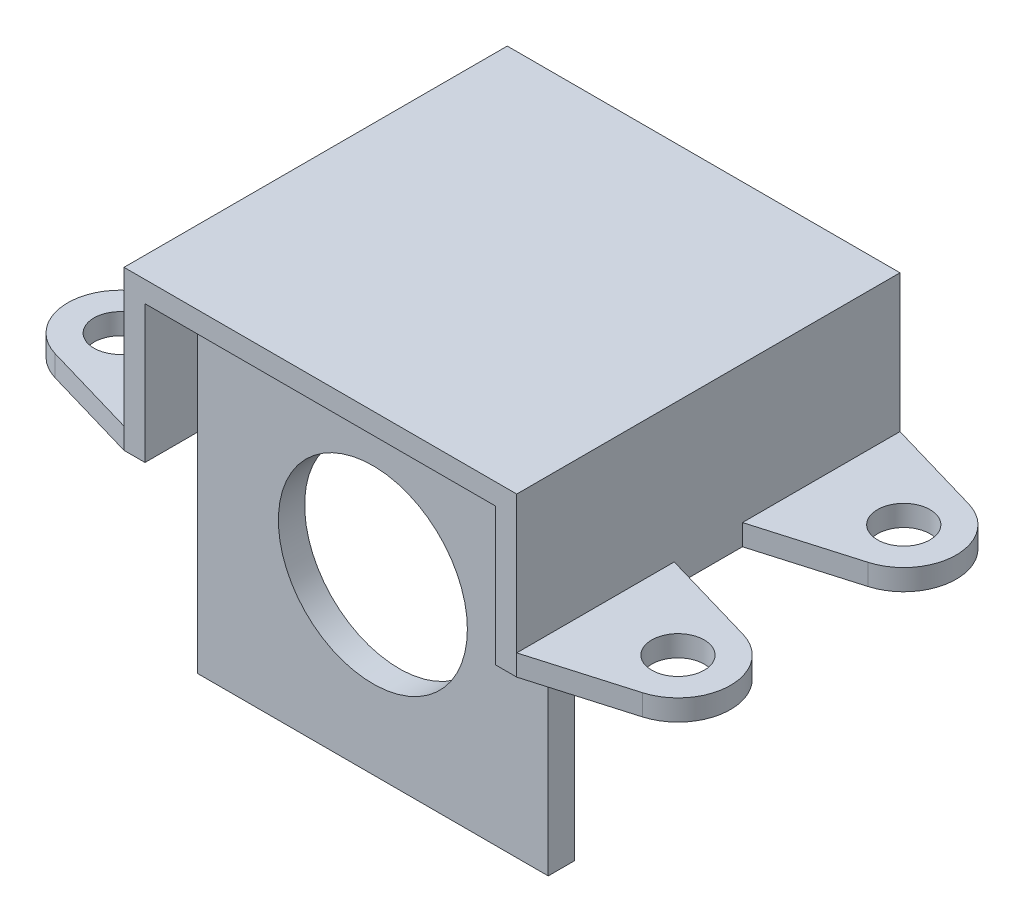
ISO-10303-21;
HEADER;
FILE_DESCRIPTION(('STEP AP214'),'2;1');
FILE_NAME('part.step','',(''),(''),'','','');
FILE_SCHEMA(('AUTOMOTIVE_DESIGN { 1 0 10303 214 1 1 1 1 }'));
ENDSEC;
DATA;
#1=APPLICATION_CONTEXT('core data for automotive mechanical design processes');
#2=APPLICATION_PROTOCOL_DEFINITION('international standard','automotive_design',2000,#1);
#3=PRODUCT_CONTEXT('',#1,'mechanical');
#4=PRODUCT('Part','Part','',(#3));
#5=PRODUCT_RELATED_PRODUCT_CATEGORY('part','',(#4));
#6=PRODUCT_DEFINITION_FORMATION('','',#4);
#7=PRODUCT_DEFINITION_CONTEXT('part definition',#1,'design');
#8=PRODUCT_DEFINITION('design','',#6,#7);
#9=PRODUCT_DEFINITION_SHAPE('','',#8);
#10=(LENGTH_UNIT() NAMED_UNIT(*) SI_UNIT(.MILLI.,.METRE.));
#11=(NAMED_UNIT(*) PLANE_ANGLE_UNIT() SI_UNIT($,.RADIAN.));
#12=(NAMED_UNIT(*) SI_UNIT($,.STERADIAN.) SOLID_ANGLE_UNIT());
#13=UNCERTAINTY_MEASURE_WITH_UNIT(LENGTH_MEASURE(1.E-05),#10,'distance_accuracy_value','');
#14=(GEOMETRIC_REPRESENTATION_CONTEXT(3) GLOBAL_UNCERTAINTY_ASSIGNED_CONTEXT((#13)) GLOBAL_UNIT_ASSIGNED_CONTEXT((#10,
#11,#12)) REPRESENTATION_CONTEXT('',''));
#15=CARTESIAN_POINT('',(0.,0.,0.));
#16=DIRECTION('',(0.,0.,1.));
#17=DIRECTION('',(1.,0.,0.));
#18=AXIS2_PLACEMENT_3D('',#15,#16,#17);
#19=CARTESIAN_POINT('',(0.,13.5410964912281,0.));
#20=DIRECTION('',(0.,-1.,0.));
#21=DIRECTION('',(0.,0.,-1.));
#22=AXIS2_PLACEMENT_3D('',#19,#20,#21);
#23=PLANE('',#22);
#24=DIRECTION('',(0.,0.,1.));
#25=VECTOR('',#24,1.);
#26=CARTESIAN_POINT('',(-26.5920175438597,13.5410964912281,9.525));
#27=LINE('',#26,#25);
#28=CARTESIAN_POINT('',(-26.5920175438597,13.5410964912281,-34.29));
#29=VERTEX_POINT('',#28);
#30=CARTESIAN_POINT('',(-26.5920175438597,13.5410964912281,0.));
#31=VERTEX_POINT('',#30);
#32=EDGE_CURVE('E37',#29,#31,#27,.T.);
#33=ORIENTED_EDGE('',*,*,#32,.F.);
#34=DIRECTION('',(1.,0.,0.));
#35=VECTOR('',#34,1.);
#36=CARTESIAN_POINT('',(15.8259824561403,13.5410964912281,-34.29));
#37=LINE('',#36,#35);
#38=CARTESIAN_POINT('',(15.8259824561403,13.5410964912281,-34.29));
#39=VERTEX_POINT('',#38);
#40=EDGE_CURVE('E53',#29,#39,#37,.T.);
#41=ORIENTED_EDGE('',*,*,#40,.T.);
#42=DIRECTION('',(0.,0.,-1.));
#43=VECTOR('',#42,1.);
#44=CARTESIAN_POINT('',(15.8259824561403,13.5410964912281,9.525));
#45=LINE('',#44,#43);
#46=CARTESIAN_POINT('',(15.8259824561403,13.5410964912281,0.));
#47=VERTEX_POINT('',#46);
#48=EDGE_CURVE('E411',#47,#39,#45,.T.);
#49=ORIENTED_EDGE('',*,*,#48,.F.);
#50=DIRECTION('',(-1.,0.,0.));
#51=VECTOR('',#50,1.);
#52=CARTESIAN_POINT('',(-26.5920175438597,13.5410964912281,0.));
#53=LINE('',#52,#51);
#54=EDGE_CURVE('E425',#47,#31,#53,.T.);
#55=ORIENTED_EDGE('',*,*,#54,.T.);
#56=EDGE_LOOP('',(#33,#41,#49,#55));
#57=FACE_BOUND('',#56,.T.);
#58=ADVANCED_FACE('F33',(#57),#23,.T.);
#59=CARTESIAN_POINT('',(15.8259824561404,0.,0.));
#60=DIRECTION('',(1.,0.,0.));
#61=DIRECTION('',(0.,1.,0.));
#62=AXIS2_PLACEMENT_3D('',#59,#60,#61);
#63=PLANE('',#62);
#64=DIRECTION('',(0.,-1.,0.));
#65=VECTOR('',#64,1.);
#66=CARTESIAN_POINT('',(15.8259824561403,13.5410964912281,-34.29));
#67=LINE('',#66,#65);
#68=CARTESIAN_POINT('',(15.8259824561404,-3.09590350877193,-34.29));
#69=VERTEX_POINT('',#68);
#70=EDGE_CURVE('E60',#39,#69,#67,.T.);
#71=ORIENTED_EDGE('',*,*,#70,.T.);
#72=DIRECTION('',(0.,0.,-1.));
#73=VECTOR('',#72,1.);
#74=CARTESIAN_POINT('',(15.8259824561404,-3.09590350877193,9.525));
#75=LINE('',#74,#73);
#76=CARTESIAN_POINT('',(15.8259824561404,-3.09590350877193,0.));
#77=VERTEX_POINT('',#76);
#78=EDGE_CURVE('E479',#77,#69,#75,.T.);
#79=ORIENTED_EDGE('',*,*,#78,.F.);
#80=DIRECTION('',(0.,1.,0.));
#81=VECTOR('',#80,1.);
#82=CARTESIAN_POINT('',(15.8259824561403,13.5410964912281,0.));
#83=LINE('',#82,#81);
#84=EDGE_CURVE('E417',#77,#47,#83,.T.);
#85=ORIENTED_EDGE('',*,*,#84,.T.);
#86=ORIENTED_EDGE('',*,*,#48,.T.);
#87=EDGE_LOOP('',(#71,#79,#85,#86));
#88=FACE_BOUND('',#87,.T.);
#89=ADVANCED_FACE('F557',(#88),#63,.F.);
#90=CARTESIAN_POINT('',(-26.5920175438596,0.,0.));
#91=DIRECTION('',(-1.,0.,0.));
#92=DIRECTION('',(0.,1.,0.));
#93=AXIS2_PLACEMENT_3D('',#90,#91,#92);
#94=PLANE('',#93);
#95=DIRECTION('',(0.,1.,0.));
#96=VECTOR('',#95,1.);
#97=CARTESIAN_POINT('',(-26.5920175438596,13.5410964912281,-34.29));
#98=LINE('',#97,#96);
#99=CARTESIAN_POINT('',(-26.5920175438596,-3.09590350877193,-34.29));
#100=VERTEX_POINT('',#99);
#101=EDGE_CURVE('E598',#100,#29,#98,.T.);
#102=ORIENTED_EDGE('',*,*,#101,.T.);
#103=ORIENTED_EDGE('',*,*,#32,.T.);
#104=DIRECTION('',(0.,-1.,0.));
#105=VECTOR('',#104,1.);
#106=CARTESIAN_POINT('',(-26.5920175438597,13.5410964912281,0.));
#107=LINE('',#106,#105);
#108=CARTESIAN_POINT('',(-26.5920175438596,-3.09590350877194,0.));
#109=VERTEX_POINT('',#108);
#110=EDGE_CURVE('E433',#31,#109,#107,.T.);
#111=ORIENTED_EDGE('',*,*,#110,.T.);
#112=DIRECTION('',(0.,0.,-1.));
#113=VECTOR('',#112,1.);
#114=CARTESIAN_POINT('',(-26.5920175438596,-3.09590350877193,9.525));
#115=LINE('',#114,#113);
#116=EDGE_CURVE('E46',#109,#100,#115,.T.);
#117=ORIENTED_EDGE('',*,*,#116,.T.);
#118=EDGE_LOOP('',(#102,#103,#111,#117));
#119=FACE_BOUND('',#118,.T.);
#120=ADVANCED_FACE('F564',(#119),#94,.F.);
#121=CARTESIAN_POINT('',(15.8259824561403,13.5410964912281,3.175));
#122=DIRECTION('',(-1.,0.,0.));
#123=DIRECTION('',(0.,-1.,0.));
#124=AXIS2_PLACEMENT_3D('',#121,#122,#123);
#125=PLANE('',#124);
#126=CARTESIAN_POINT('',(15.8259824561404,-3.09590350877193,3.175));
#127=VERTEX_POINT('',#126);
#128=EDGE_CURVE('E43',#127,#77,#75,.T.);
#129=ORIENTED_EDGE('',*,*,#128,.F.);
#130=DIRECTION('',(0.,1.,0.));
#131=VECTOR('',#130,1.);
#132=CARTESIAN_POINT('',(15.8259824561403,13.5410964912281,3.175));
#133=LINE('',#132,#131);
#134=CARTESIAN_POINT('',(15.8259824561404,-28.3689035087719,3.175));
#135=VERTEX_POINT('',#134);
#136=EDGE_CURVE('E415',#135,#127,#133,.T.);
#137=ORIENTED_EDGE('',*,*,#136,.F.);
#138=DIRECTION('',(0.,0.,-1.));
#139=VECTOR('',#138,1.);
#140=CARTESIAN_POINT('',(15.8259824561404,-28.3689035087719,3.175));
#141=LINE('',#140,#139);
#142=CARTESIAN_POINT('',(15.8259824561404,-28.3689035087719,0.));
#143=VERTEX_POINT('',#142);
#144=EDGE_CURVE('E439',#135,#143,#141,.T.);
#145=ORIENTED_EDGE('',*,*,#144,.T.);
#146=EDGE_CURVE('E423',#143,#77,#83,.T.);
#147=ORIENTED_EDGE('',*,*,#146,.T.);
#148=EDGE_LOOP('',(#129,#137,#145,#147));
#149=FACE_BOUND('',#148,.T.);
#150=ADVANCED_FACE('F492',(#149),#125,.F.);
#151=CARTESIAN_POINT('',(0.,0.,3.175));
#152=DIRECTION('',(0.,0.,1.));
#153=DIRECTION('',(1.,0.,0.));
#154=AXIS2_PLACEMENT_3D('',#151,#152,#153);
#155=PLANE('',#154);
#156=DIRECTION('',(0.,-1.,0.));
#157=VECTOR('',#156,1.);
#158=CARTESIAN_POINT('',(-26.5920175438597,13.5410964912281,3.175));
#159=LINE('',#158,#157);
#160=CARTESIAN_POINT('',(-26.5920175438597,13.5410964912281,3.175));
#161=VERTEX_POINT('',#160);
#162=CARTESIAN_POINT('',(-26.5920175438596,-3.09590350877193,3.175));
#163=VERTEX_POINT('',#162);
#164=EDGE_CURVE('E448',#161,#163,#159,.T.);
#165=ORIENTED_EDGE('',*,*,#164,.T.);
#166=CARTESIAN_POINT('',(-26.5920175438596,-28.3689035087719,3.175));
#167=VERTEX_POINT('',#166);
#168=EDGE_CURVE('E432',#163,#167,#159,.T.);
#169=ORIENTED_EDGE('',*,*,#168,.T.);
#170=DIRECTION('',(1.,0.,0.));
#171=VECTOR('',#170,1.);
#172=CARTESIAN_POINT('',(-26.5920175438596,-28.3689035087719,3.175));
#173=LINE('',#172,#171);
#174=EDGE_CURVE('E416',#167,#135,#173,.T.);
#175=ORIENTED_EDGE('',*,*,#174,.T.);
#176=ORIENTED_EDGE('',*,*,#136,.T.);
#177=CARTESIAN_POINT('',(15.8259824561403,13.5410964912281,3.175));
#178=VERTEX_POINT('',#177);
#179=EDGE_CURVE('E412',#127,#178,#133,.T.);
#180=ORIENTED_EDGE('',*,*,#179,.T.);
#181=DIRECTION('',(-1.,0.,0.));
#182=VECTOR('',#181,1.);
#183=CARTESIAN_POINT('',(-26.5920175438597,13.5410964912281,3.175));
#184=LINE('',#183,#182);
#185=EDGE_CURVE('E443',#178,#161,#184,.T.);
#186=ORIENTED_EDGE('',*,*,#185,.T.);
#187=EDGE_LOOP('',(#165,#169,#175,#176,#180,#186));
#188=FACE_BOUND('',#187,.T.);
#189=CARTESIAN_POINT('',(-5.38301754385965,-7.41390350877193,3.175));
#190=DIRECTION('',(0.,0.,1.));
#191=DIRECTION('',(1.,0.,0.));
#192=AXIS2_PLACEMENT_3D('',#189,#190,#191);
#193=CIRCLE('',#192,11.43);
#194=CARTESIAN_POINT('',(6.04698245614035,-7.41390350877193,3.175));
#195=VERTEX_POINT('',#194);
#196=EDGE_CURVE('E455',#195,#195,#193,.T.);
#197=ORIENTED_EDGE('',*,*,#196,.F.);
#198=EDGE_LOOP('',(#197));
#199=FACE_BOUND('',#198,.T.);
#200=ADVANCED_FACE('F498',(#188,#199),#155,.T.);
#201=CARTESIAN_POINT('',(0.,0.,0.));
#202=DIRECTION('',(0.,0.,1.));
#203=DIRECTION('',(1.,0.,0.));
#204=AXIS2_PLACEMENT_3D('',#201,#202,#203);
#205=PLANE('',#204);
#206=ORIENTED_EDGE('',*,*,#110,.F.);
#207=ORIENTED_EDGE('',*,*,#54,.F.);
#208=ORIENTED_EDGE('',*,*,#84,.F.);
#209=ORIENTED_EDGE('',*,*,#146,.F.);
#210=DIRECTION('',(1.,0.,0.));
#211=VECTOR('',#210,1.);
#212=CARTESIAN_POINT('',(-26.5920175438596,-28.3689035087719,0.));
#213=LINE('',#212,#211);
#214=CARTESIAN_POINT('',(-26.5920175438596,-28.3689035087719,0.));
#215=VERTEX_POINT('',#214);
#216=EDGE_CURVE('E437',#215,#143,#213,.T.);
#217=ORIENTED_EDGE('',*,*,#216,.F.);
#218=EDGE_CURVE('E396',#109,#215,#107,.T.);
#219=ORIENTED_EDGE('',*,*,#218,.F.);
#220=EDGE_LOOP('',(#206,#207,#208,#209,#217,#219));
#221=FACE_BOUND('',#220,.T.);
#222=CARTESIAN_POINT('',(-5.38301754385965,-7.41390350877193,0.));
#223=DIRECTION('',(0.,0.,1.));
#224=DIRECTION('',(1.,0.,0.));
#225=AXIS2_PLACEMENT_3D('',#222,#223,#224);
#226=CIRCLE('',#225,11.43);
#227=CARTESIAN_POINT('',(6.04698245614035,-7.41390350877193,0.));
#228=VERTEX_POINT('',#227);
#229=EDGE_CURVE('E452',#228,#228,#226,.T.);
#230=ORIENTED_EDGE('',*,*,#229,.T.);
#231=EDGE_LOOP('',(#230));
#232=FACE_BOUND('',#231,.T.);
#233=ADVANCED_FACE('F591',(#221,#232),#205,.F.);
#234=CARTESIAN_POINT('',(-26.5920175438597,13.5410964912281,3.175));
#235=DIRECTION('',(1.,0.,0.));
#236=DIRECTION('',(0.,1.,0.));
#237=AXIS2_PLACEMENT_3D('',#234,#235,#236);
#238=PLANE('',#237);
#239=ORIENTED_EDGE('',*,*,#168,.F.);
#240=EDGE_CURVE('E11',#163,#109,#115,.T.);
#241=ORIENTED_EDGE('',*,*,#240,.T.);
#242=ORIENTED_EDGE('',*,*,#218,.T.);
#243=DIRECTION('',(0.,0.,-1.));
#244=VECTOR('',#243,1.);
#245=CARTESIAN_POINT('',(-26.5920175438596,-28.3689035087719,3.175));
#246=LINE('',#245,#244);
#247=EDGE_CURVE('E442',#167,#215,#246,.T.);
#248=ORIENTED_EDGE('',*,*,#247,.F.);
#249=EDGE_LOOP('',(#239,#241,#242,#248));
#250=FACE_BOUND('',#249,.T.);
#251=ADVANCED_FACE('F35',(#250),#238,.F.);
#252=CARTESIAN_POINT('',(-26.5920175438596,-28.3689035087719,3.175));
#253=DIRECTION('',(0.,1.,0.));
#254=DIRECTION('',(0.,0.,1.));
#255=AXIS2_PLACEMENT_3D('',#252,#253,#254);
#256=PLANE('',#255);
#257=ORIENTED_EDGE('',*,*,#216,.T.);
#258=ORIENTED_EDGE('',*,*,#144,.F.);
#259=ORIENTED_EDGE('',*,*,#174,.F.);
#260=ORIENTED_EDGE('',*,*,#247,.T.);
#261=EDGE_LOOP('',(#257,#258,#259,#260));
#262=FACE_BOUND('',#261,.T.);
#263=ADVANCED_FACE('F577',(#262),#256,.F.);
#264=CARTESIAN_POINT('',(-5.38301754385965,-7.41390350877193,3.175));
#265=DIRECTION('',(0.,0.,-1.));
#266=DIRECTION('',(-1.,0.,0.));
#267=AXIS2_PLACEMENT_3D('',#264,#265,#266);
#268=CYLINDRICAL_SURFACE('',#267,11.43);
#269=ORIENTED_EDGE('',*,*,#196,.T.);
#270=EDGE_LOOP('',(#269));
#271=FACE_BOUND('',#270,.T.);
#272=ORIENTED_EDGE('',*,*,#229,.F.);
#273=EDGE_LOOP('',(#272));
#274=FACE_BOUND('',#273,.T.);
#275=ADVANCED_FACE('F569',(#271,#274),#268,.F.);
#276=ORIENTED_EDGE('',*,*,#185,.F.);
#277=CARTESIAN_POINT('',(15.8259824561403,13.5410964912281,9.525));
#278=VERTEX_POINT('',#277);
#279=EDGE_CURVE('E461',#278,#178,#45,.T.);
#280=ORIENTED_EDGE('',*,*,#279,.F.);
#281=DIRECTION('',(1.,0.,0.));
#282=VECTOR('',#281,1.);
#283=CARTESIAN_POINT('',(-26.5920175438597,13.5410964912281,9.525));
#284=LINE('',#283,#282);
#285=CARTESIAN_POINT('',(-26.5920175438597,13.5410964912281,9.525));
#286=VERTEX_POINT('',#285);
#287=EDGE_CURVE('E409',#286,#278,#284,.T.);
#288=ORIENTED_EDGE('',*,*,#287,.F.);
#289=EDGE_CURVE('E466',#161,#286,#27,.T.);
#290=ORIENTED_EDGE('',*,*,#289,.F.);
#291=EDGE_LOOP('',(#276,#280,#288,#290));
#292=FACE_BOUND('',#291,.T.);
#293=ADVANCED_FACE('F559',(#292),#23,.T.);
#294=CARTESIAN_POINT('',(-26.5920175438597,16.0810964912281,9.525));
#295=DIRECTION('',(0.,0.,-1.));
#296=DIRECTION('',(-1.,0.,0.));
#297=AXIS2_PLACEMENT_3D('',#294,#295,#296);
#298=PLANE('',#297);
#299=ORIENTED_EDGE('',*,*,#287,.T.);
#300=DIRECTION('',(0.,-1.,0.));
#301=VECTOR('',#300,1.);
#302=CARTESIAN_POINT('',(15.8259824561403,16.0810964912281,9.525));
#303=LINE('',#302,#301);
#304=CARTESIAN_POINT('',(15.8259824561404,-3.09590350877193,9.525));
#305=VERTEX_POINT('',#304);
#306=EDGE_CURVE('E382',#278,#305,#303,.T.);
#307=ORIENTED_EDGE('',*,*,#306,.T.);
#308=DIRECTION('',(-1.,0.,0.));
#309=VECTOR('',#308,1.);
#310=CARTESIAN_POINT('',(18.3659824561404,-3.09590350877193,9.525));
#311=LINE('',#310,#309);
#312=CARTESIAN_POINT('',(18.3659824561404,-3.09590350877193,9.525));
#313=VERTEX_POINT('',#312);
#314=EDGE_CURVE('E468',#313,#305,#311,.T.);
#315=ORIENTED_EDGE('',*,*,#314,.F.);
#316=DIRECTION('',(0.,-1.,0.));
#317=VECTOR('',#316,1.);
#318=CARTESIAN_POINT('',(18.3659824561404,-0.555903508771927,9.525));
#319=LINE('',#318,#317);
#320=CARTESIAN_POINT('',(18.3659824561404,-0.55590350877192,9.525));
#321=VERTEX_POINT('',#320);
#322=EDGE_CURVE('E345',#321,#313,#319,.T.);
#323=ORIENTED_EDGE('',*,*,#322,.F.);
#324=DIRECTION('',(0.,-1.,0.));
#325=VECTOR('',#324,1.);
#326=CARTESIAN_POINT('',(18.3659824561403,16.0810964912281,9.525));
#327=LINE('',#326,#325);
#328=CARTESIAN_POINT('',(18.3659824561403,16.0810964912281,9.525));
#329=VERTEX_POINT('',#328);
#330=EDGE_CURVE('E395',#329,#321,#327,.T.);
#331=ORIENTED_EDGE('',*,*,#330,.F.);
#332=DIRECTION('',(1.,0.,0.));
#333=VECTOR('',#332,1.);
#334=CARTESIAN_POINT('',(-26.5920175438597,16.0810964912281,9.525));
#335=LINE('',#334,#333);
#336=CARTESIAN_POINT('',(-29.1320175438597,16.0810964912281,9.525));
#337=VERTEX_POINT('',#336);
#338=EDGE_CURVE('E262',#337,#329,#335,.T.);
#339=ORIENTED_EDGE('',*,*,#338,.F.);
#340=DIRECTION('',(0.,-1.,0.));
#341=VECTOR('',#340,1.);
#342=CARTESIAN_POINT('',(-29.1320175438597,16.0810964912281,9.525));
#343=LINE('',#342,#341);
#344=CARTESIAN_POINT('',(-29.1320175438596,-0.555903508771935,9.525));
#345=VERTEX_POINT('',#344);
#346=EDGE_CURVE('E254',#337,#345,#343,.T.);
#347=ORIENTED_EDGE('',*,*,#346,.T.);
#348=DIRECTION('',(0.,-1.,0.));
#349=VECTOR('',#348,1.);
#350=CARTESIAN_POINT('',(-29.1320175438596,-0.555903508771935,9.525));
#351=LINE('',#350,#349);
#352=CARTESIAN_POINT('',(-29.1320175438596,-3.09590350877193,9.525));
#353=VERTEX_POINT('',#352);
#354=EDGE_CURVE('E238',#345,#353,#351,.T.);
#355=ORIENTED_EDGE('',*,*,#354,.T.);
#356=DIRECTION('',(1.,0.,0.));
#357=VECTOR('',#356,1.);
#358=CARTESIAN_POINT('',(-29.1320175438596,-3.09590350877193,9.525));
#359=LINE('',#358,#357);
#360=CARTESIAN_POINT('',(-26.5920175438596,-3.09590350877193,9.525));
#361=VERTEX_POINT('',#360);
#362=EDGE_CURVE('E306',#353,#361,#359,.T.);
#363=ORIENTED_EDGE('',*,*,#362,.T.);
#364=DIRECTION('',(0.,-1.,0.));
#365=VECTOR('',#364,1.);
#366=CARTESIAN_POINT('',(-26.5920175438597,16.0810964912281,9.525));
#367=LINE('',#366,#365);
#368=EDGE_CURVE('E318',#286,#361,#367,.T.);
#369=ORIENTED_EDGE('',*,*,#368,.F.);
#370=EDGE_LOOP('',(#299,#307,#315,#323,#331,#339,#347,#355,#363,#369));
#371=FACE_BOUND('',#370,.T.);
#372=ADVANCED_FACE('F260',(#371),#298,.F.);
#373=CARTESIAN_POINT('',(-26.5920175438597,16.0810964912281,-36.83));
#374=DIRECTION('',(0.,0.,1.));
#375=DIRECTION('',(1.,0.,0.));
#376=AXIS2_PLACEMENT_3D('',#373,#374,#375);
#377=PLANE('',#376);
#378=DIRECTION('',(-1.,0.,0.));
#379=VECTOR('',#378,1.);
#380=CARTESIAN_POINT('',(18.3659824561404,-3.09590350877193,-36.83));
#381=LINE('',#380,#379);
#382=CARTESIAN_POINT('',(18.3659824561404,-3.09590350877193,-36.83));
#383=VERTEX_POINT('',#382);
#384=CARTESIAN_POINT('',(-29.1320175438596,-3.09590350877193,-36.83));
#385=VERTEX_POINT('',#384);
#386=EDGE_CURVE('E472',#383,#385,#381,.T.);
#387=ORIENTED_EDGE('',*,*,#386,.T.);
#388=DIRECTION('',(0.,1.,0.));
#389=VECTOR('',#388,1.);
#390=CARTESIAN_POINT('',(-29.1320175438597,16.0810964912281,-36.83));
#391=LINE('',#390,#389);
#392=CARTESIAN_POINT('',(-29.1320175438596,-0.555903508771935,-36.83));
#393=VERTEX_POINT('',#392);
#394=EDGE_CURVE('E280',#385,#393,#391,.T.);
#395=ORIENTED_EDGE('',*,*,#394,.T.);
#396=CARTESIAN_POINT('',(-29.1320175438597,16.0810964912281,-36.83));
#397=VERTEX_POINT('',#396);
#398=EDGE_CURVE('E265',#393,#397,#391,.T.);
#399=ORIENTED_EDGE('',*,*,#398,.T.);
#400=DIRECTION('',(-1.,0.,0.));
#401=VECTOR('',#400,1.);
#402=CARTESIAN_POINT('',(-26.5920175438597,16.0810964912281,-36.83));
#403=LINE('',#402,#401);
#404=CARTESIAN_POINT('',(18.3659824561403,16.0810964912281,-36.83));
#405=VERTEX_POINT('',#404);
#406=EDGE_CURVE('E456',#405,#397,#403,.T.);
#407=ORIENTED_EDGE('',*,*,#406,.F.);
#408=DIRECTION('',(0.,1.,0.));
#409=VECTOR('',#408,1.);
#410=CARTESIAN_POINT('',(18.3659824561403,16.0810964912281,-36.83));
#411=LINE('',#410,#409);
#412=CARTESIAN_POINT('',(18.3659824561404,-0.555903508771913,-36.83));
#413=VERTEX_POINT('',#412);
#414=EDGE_CURVE('E394',#413,#405,#411,.T.);
#415=ORIENTED_EDGE('',*,*,#414,.F.);
#416=EDGE_CURVE('E372',#383,#413,#411,.T.);
#417=ORIENTED_EDGE('',*,*,#416,.F.);
#418=EDGE_LOOP('',(#387,#395,#399,#407,#415,#417));
#419=FACE_BOUND('',#418,.T.);
#420=ADVANCED_FACE('F521',(#419),#377,.F.);
#421=CARTESIAN_POINT('',(0.,16.0810964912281,0.));
#422=DIRECTION('',(0.,-1.,0.));
#423=DIRECTION('',(0.,0.,-1.));
#424=AXIS2_PLACEMENT_3D('',#421,#422,#423);
#425=PLANE('',#424);
#426=ORIENTED_EDGE('',*,*,#406,.T.);
#427=DIRECTION('',(0.,0.,1.));
#428=VECTOR('',#427,1.);
#429=CARTESIAN_POINT('',(-29.1320175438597,16.0810964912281,9.525));
#430=LINE('',#429,#428);
#431=EDGE_CURVE('E263',#397,#337,#430,.T.);
#432=ORIENTED_EDGE('',*,*,#431,.T.);
#433=ORIENTED_EDGE('',*,*,#338,.T.);
#434=DIRECTION('',(0.,0.,1.));
#435=VECTOR('',#434,1.);
#436=CARTESIAN_POINT('',(18.3659824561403,16.0810964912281,9.525));
#437=LINE('',#436,#435);
#438=EDGE_CURVE('E403',#405,#329,#437,.T.);
#439=ORIENTED_EDGE('',*,*,#438,.F.);
#440=EDGE_LOOP('',(#426,#432,#433,#439));
#441=FACE_BOUND('',#440,.T.);
#442=ADVANCED_FACE('F515',(#441),#425,.F.);
#443=ORIENTED_EDGE('',*,*,#306,.F.);
#444=ORIENTED_EDGE('',*,*,#279,.T.);
#445=ORIENTED_EDGE('',*,*,#179,.F.);
#446=EDGE_CURVE('E481',#305,#127,#75,.T.);
#447=ORIENTED_EDGE('',*,*,#446,.F.);
#448=EDGE_LOOP('',(#443,#444,#445,#447));
#449=FACE_BOUND('',#448,.T.);
#450=ADVANCED_FACE('F506',(#449),#63,.F.);
#451=CARTESIAN_POINT('',(18.3659824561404,-3.09590350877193,9.525));
#452=DIRECTION('',(0.,1.,0.));
#453=DIRECTION('',(-1.,0.,0.));
#454=AXIS2_PLACEMENT_3D('',#451,#452,#453);
#455=PLANE('',#454);
#456=ORIENTED_EDGE('',*,*,#446,.T.);
#457=ORIENTED_EDGE('',*,*,#128,.T.);
#458=ORIENTED_EDGE('',*,*,#78,.T.);
#459=DIRECTION('',(-1.,0.,0.));
#460=VECTOR('',#459,1.);
#461=CARTESIAN_POINT('',(15.8259824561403,-3.09590350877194,-34.29));
#462=LINE('',#461,#460);
#463=EDGE_CURVE('E601',#69,#100,#462,.T.);
#464=ORIENTED_EDGE('',*,*,#463,.T.);
#465=ORIENTED_EDGE('',*,*,#116,.F.);
#466=ORIENTED_EDGE('',*,*,#240,.F.);
#467=EDGE_CURVE('E45',#361,#163,#115,.T.);
#468=ORIENTED_EDGE('',*,*,#467,.F.);
#469=ORIENTED_EDGE('',*,*,#362,.F.);
#470=DIRECTION('',(0.960023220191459,0.,0.279920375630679));
#471=VECTOR('',#470,1.);
#472=CARTESIAN_POINT('',(-29.1320175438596,-3.09590350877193,9.525));
#473=LINE('',#472,#471);
#474=CARTESIAN_POINT('',(-40.8917119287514,-3.09590350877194,6.0961474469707));
#475=VERTEX_POINT('',#474);
#476=EDGE_CURVE('E241',#475,#353,#473,.T.);
#477=ORIENTED_EDGE('',*,*,#476,.F.);
#478=CARTESIAN_POINT('',(-39.1142175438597,-3.09590350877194,0.));
#479=DIRECTION('',(0.,1.,0.));
#480=DIRECTION('',(1.,0.,0.));
#481=AXIS2_PLACEMENT_3D('',#478,#479,#480);
#482=CIRCLE('',#481,6.34999999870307);
#483=CARTESIAN_POINT('',(-40.8917119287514,-3.09590350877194,-6.09614744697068));
#484=VERTEX_POINT('',#483);
#485=EDGE_CURVE('E616',#484,#475,#482,.T.);
#486=ORIENTED_EDGE('',*,*,#485,.F.);
#487=DIRECTION('',(-0.960023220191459,0.,0.279920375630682));
#488=VECTOR('',#487,1.);
#489=CARTESIAN_POINT('',(-29.1320175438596,-3.09590350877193,-9.525));
#490=LINE('',#489,#488);
#491=CARTESIAN_POINT('',(-29.1320175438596,-3.09590350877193,-9.525));
#492=VERTEX_POINT('',#491);
#493=EDGE_CURVE('E258',#492,#484,#490,.T.);
#494=ORIENTED_EDGE('',*,*,#493,.F.);
#495=DIRECTION('',(0.,0.,-1.));
#496=VECTOR('',#495,1.);
#497=CARTESIAN_POINT('',(-29.1320175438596,-3.09590350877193,9.525));
#498=LINE('',#497,#496);
#499=CARTESIAN_POINT('',(-29.1320175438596,-3.09590350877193,-17.78));
#500=VERTEX_POINT('',#499);
#501=EDGE_CURVE('E283',#492,#500,#498,.T.);
#502=ORIENTED_EDGE('',*,*,#501,.T.);
#503=DIRECTION('',(0.9600208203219,0.,0.279928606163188));
#504=VECTOR('',#503,1.);
#505=CARTESIAN_POINT('',(-29.1320175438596,-3.09590350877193,-17.78));
#506=LINE('',#505,#504);
#507=CARTESIAN_POINT('',(-40.8917347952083,-3.09590350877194,-21.2089686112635));
#508=VERTEX_POINT('',#507);
#509=EDGE_CURVE('E289',#508,#500,#506,.T.);
#510=ORIENTED_EDGE('',*,*,#509,.F.);
#511=CARTESIAN_POINT('',(-39.1142175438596,-3.09590350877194,-27.305));
#512=DIRECTION('',(0.,1.,0.));
#513=DIRECTION('',(1.,0.,0.));
#514=AXIS2_PLACEMENT_3D('',#511,#512,#513);
#515=CIRCLE('',#514,6.34989498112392);
#516=CARTESIAN_POINT('',(-40.8917347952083,-3.09590350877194,-33.4010313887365));
#517=VERTEX_POINT('',#516);
#518=EDGE_CURVE('E292',#517,#508,#515,.T.);
#519=ORIENTED_EDGE('',*,*,#518,.F.);
#520=DIRECTION('',(-0.9600208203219,0.,0.279928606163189));
#521=VECTOR('',#520,1.);
#522=CARTESIAN_POINT('',(-29.1320175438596,-3.09590350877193,-36.83));
#523=LINE('',#522,#521);
#524=EDGE_CURVE('E304',#385,#517,#523,.T.);
#525=ORIENTED_EDGE('',*,*,#524,.F.);
#526=ORIENTED_EDGE('',*,*,#386,.F.);
#527=DIRECTION('',(0.9600208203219,0.,0.279928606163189));
#528=VECTOR('',#527,1.);
#529=CARTESIAN_POINT('',(18.3659824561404,-3.09590350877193,-36.83));
#530=LINE('',#529,#528);
#531=CARTESIAN_POINT('',(30.125699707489,-3.09590350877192,-33.4010313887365));
#532=VERTEX_POINT('',#531);
#533=EDGE_CURVE('E358',#383,#532,#530,.T.);
#534=ORIENTED_EDGE('',*,*,#533,.T.);
#535=CARTESIAN_POINT('',(28.3481824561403,-3.09590350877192,-27.305));
#536=DIRECTION('',(0.,-1.,0.));
#537=DIRECTION('',(-1.,0.,0.));
#538=AXIS2_PLACEMENT_3D('',#535,#536,#537);
#539=CIRCLE('',#538,6.34989498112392);
#540=CARTESIAN_POINT('',(30.125699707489,-3.09590350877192,-21.2089686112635));
#541=VERTEX_POINT('',#540);
#542=EDGE_CURVE('E388',#532,#541,#539,.T.);
#543=ORIENTED_EDGE('',*,*,#542,.T.);
#544=DIRECTION('',(-0.9600208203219,0.,0.279928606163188));
#545=VECTOR('',#544,1.);
#546=CARTESIAN_POINT('',(18.3659824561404,-3.09590350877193,-17.78));
#547=LINE('',#546,#545);
#548=CARTESIAN_POINT('',(18.3659824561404,-3.09590350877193,-17.78));
#549=VERTEX_POINT('',#548);
#550=EDGE_CURVE('E371',#541,#549,#547,.T.);
#551=ORIENTED_EDGE('',*,*,#550,.T.);
#552=DIRECTION('',(0.,0.,-1.));
#553=VECTOR('',#552,1.);
#554=CARTESIAN_POINT('',(18.3659824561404,-3.09590350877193,9.525));
#555=LINE('',#554,#553);
#556=CARTESIAN_POINT('',(18.3659824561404,-3.09590350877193,-9.525));
#557=VERTEX_POINT('',#556);
#558=EDGE_CURVE('E391',#557,#549,#555,.T.);
#559=ORIENTED_EDGE('',*,*,#558,.F.);
#560=DIRECTION('',(0.960023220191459,0.,0.279920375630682));
#561=VECTOR('',#560,1.);
#562=CARTESIAN_POINT('',(18.3659824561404,-3.09590350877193,-9.525));
#563=LINE('',#562,#561);
#564=CARTESIAN_POINT('',(30.1256768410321,-3.09590350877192,-6.09614744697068));
#565=VERTEX_POINT('',#564);
#566=EDGE_CURVE('E323',#557,#565,#563,.T.);
#567=ORIENTED_EDGE('',*,*,#566,.T.);
#568=CARTESIAN_POINT('',(28.3481824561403,-3.09590350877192,0.));
#569=DIRECTION('',(0.,-1.,0.));
#570=DIRECTION('',(-1.,0.,0.));
#571=AXIS2_PLACEMENT_3D('',#568,#569,#570);
#572=CIRCLE('',#571,6.34999999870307);
#573=CARTESIAN_POINT('',(30.1256768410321,-3.09590350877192,6.0961474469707));
#574=VERTEX_POINT('',#573);
#575=EDGE_CURVE('E340',#565,#574,#572,.T.);
#576=ORIENTED_EDGE('',*,*,#575,.T.);
#577=DIRECTION('',(-0.960023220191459,0.,0.279920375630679));
#578=VECTOR('',#577,1.);
#579=CARTESIAN_POINT('',(18.3659824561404,-3.09590350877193,9.525));
#580=LINE('',#579,#578);
#581=EDGE_CURVE('E328',#574,#313,#580,.T.);
#582=ORIENTED_EDGE('',*,*,#581,.T.);
#583=ORIENTED_EDGE('',*,*,#314,.T.);
#584=EDGE_LOOP('',(#456,#457,#458,#464,#465,#466,#468,#469,#477,#486,#494,#502,#510,#519,#525,
#526,#534,#543,#551,#559,#567,#576,#582,#583));
#585=FACE_BOUND('',#584,.T.);
#586=CARTESIAN_POINT('',(28.3481824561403,-3.09590350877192,-27.305));
#587=DIRECTION('',(0.,-1.,0.));
#588=DIRECTION('',(1.,0.,0.));
#589=AXIS2_PLACEMENT_3D('',#586,#587,#588);
#590=CIRCLE('',#589,3.175);
#591=CARTESIAN_POINT('',(31.5231824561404,-3.09590350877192,-27.305));
#592=VERTEX_POINT('',#591);
#593=EDGE_CURVE('E348',#592,#592,#590,.T.);
#594=ORIENTED_EDGE('',*,*,#593,.F.);
#595=EDGE_LOOP('',(#594));
#596=FACE_BOUND('',#595,.T.);
#597=CARTESIAN_POINT('',(28.3481824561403,-3.09590350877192,0.));
#598=DIRECTION('',(0.,-1.,0.));
#599=DIRECTION('',(1.,0.,0.));
#600=AXIS2_PLACEMENT_3D('',#597,#598,#599);
#601=CIRCLE('',#600,3.175);
#602=CARTESIAN_POINT('',(31.5231824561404,-3.09590350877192,0.));
#603=VERTEX_POINT('',#602);
#604=EDGE_CURVE('E310',#603,#603,#601,.T.);
#605=ORIENTED_EDGE('',*,*,#604,.F.);
#606=EDGE_LOOP('',(#605));
#607=FACE_BOUND('',#606,.T.);
#608=CARTESIAN_POINT('',(-39.1142175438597,-3.09590350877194,-27.305));
#609=DIRECTION('',(0.,1.,0.));
#610=DIRECTION('',(-1.,0.,0.));
#611=AXIS2_PLACEMENT_3D('',#608,#609,#610);
#612=CIRCLE('',#611,3.175);
#613=CARTESIAN_POINT('',(-42.2892175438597,-3.09590350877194,-27.305));
#614=VERTEX_POINT('',#613);
#615=EDGE_CURVE('E620',#614,#614,#612,.T.);
#616=ORIENTED_EDGE('',*,*,#615,.T.);
#617=EDGE_LOOP('',(#616));
#618=FACE_BOUND('',#617,.T.);
#619=CARTESIAN_POINT('',(-39.1142175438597,-3.09590350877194,0.));
#620=DIRECTION('',(0.,1.,0.));
#621=DIRECTION('',(-1.,0.,0.));
#622=AXIS2_PLACEMENT_3D('',#619,#620,#621);
#623=CIRCLE('',#622,3.175);
#624=CARTESIAN_POINT('',(-42.2892175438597,-3.09590350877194,0.));
#625=VERTEX_POINT('',#624);
#626=EDGE_CURVE('E607',#625,#625,#623,.T.);
#627=ORIENTED_EDGE('',*,*,#626,.T.);
#628=EDGE_LOOP('',(#627));
#629=FACE_BOUND('',#628,.T.);
#630=ADVANCED_FACE('F485',(#585,#596,#607,#618,#629),#455,.F.);
#631=CARTESIAN_POINT('',(18.3659824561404,0.,0.));
#632=DIRECTION('',(1.,0.,0.));
#633=DIRECTION('',(0.,1.,0.));
#634=AXIS2_PLACEMENT_3D('',#631,#632,#633);
#635=PLANE('',#634);
#636=DIRECTION('',(0.,-1.,0.));
#637=VECTOR('',#636,1.);
#638=CARTESIAN_POINT('',(18.3659824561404,-0.555903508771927,-9.525));
#639=LINE('',#638,#637);
#640=CARTESIAN_POINT('',(18.3659824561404,-0.555903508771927,-9.525));
#641=VERTEX_POINT('',#640);
#642=EDGE_CURVE('E337',#641,#557,#639,.T.);
#643=ORIENTED_EDGE('',*,*,#642,.T.);
#644=ORIENTED_EDGE('',*,*,#558,.T.);
#645=DIRECTION('',(0.,-1.,0.));
#646=VECTOR('',#645,1.);
#647=CARTESIAN_POINT('',(18.3659824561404,-0.555903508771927,-17.78));
#648=LINE('',#647,#646);
#649=CARTESIAN_POINT('',(18.3659824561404,-0.555903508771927,-17.78));
#650=VERTEX_POINT('',#649);
#651=EDGE_CURVE('E379',#650,#549,#648,.T.);
#652=ORIENTED_EDGE('',*,*,#651,.F.);
#653=DIRECTION('',(0.,0.,-1.));
#654=VECTOR('',#653,1.);
#655=CARTESIAN_POINT('',(18.3659824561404,-0.555903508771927,-27.305));
#656=LINE('',#655,#654);
#657=EDGE_CURVE('E366',#650,#413,#656,.T.);
#658=ORIENTED_EDGE('',*,*,#657,.T.);
#659=ORIENTED_EDGE('',*,*,#414,.T.);
#660=ORIENTED_EDGE('',*,*,#438,.T.);
#661=ORIENTED_EDGE('',*,*,#330,.T.);
#662=DIRECTION('',(0.,0.,-1.));
#663=VECTOR('',#662,1.);
#664=CARTESIAN_POINT('',(18.3659824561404,-0.555903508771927,0.));
#665=LINE('',#664,#663);
#666=EDGE_CURVE('E325',#321,#641,#665,.T.);
#667=ORIENTED_EDGE('',*,*,#666,.T.);
#668=EDGE_LOOP('',(#643,#644,#652,#658,#659,#660,#661,#667));
#669=FACE_BOUND('',#668,.T.);
#670=ADVANCED_FACE('F775',(#669),#635,.T.);
#671=CARTESIAN_POINT('',(18.3659824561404,-0.555903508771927,-17.78));
#672=DIRECTION('',(0.279928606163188,0.,0.9600208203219));
#673=DIRECTION('',(0.9600208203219,0.,-0.279928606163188));
#674=AXIS2_PLACEMENT_3D('',#671,#672,#673);
#675=PLANE('',#674);
#676=ORIENTED_EDGE('',*,*,#550,.F.);
#677=DIRECTION('',(0.,-1.,0.));
#678=VECTOR('',#677,1.);
#679=CARTESIAN_POINT('',(30.125699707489,-0.555903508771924,-21.2089686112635));
#680=LINE('',#679,#678);
#681=CARTESIAN_POINT('',(30.125699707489,-0.555903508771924,-21.2089686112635));
#682=VERTEX_POINT('',#681);
#683=EDGE_CURVE('E383',#682,#541,#680,.T.);
#684=ORIENTED_EDGE('',*,*,#683,.F.);
#685=DIRECTION('',(-0.9600208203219,0.,0.279928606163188));
#686=VECTOR('',#685,1.);
#687=CARTESIAN_POINT('',(18.3659824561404,-0.555903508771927,-17.78));
#688=LINE('',#687,#686);
#689=EDGE_CURVE('E1002',#682,#650,#688,.T.);
#690=ORIENTED_EDGE('',*,*,#689,.T.);
#691=ORIENTED_EDGE('',*,*,#651,.T.);
#692=EDGE_LOOP('',(#676,#684,#690,#691));
#693=FACE_BOUND('',#692,.T.);
#694=ADVANCED_FACE('F765',(#693),#675,.T.);
#695=CARTESIAN_POINT('',(28.3481824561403,-0.555903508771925,-27.305));
#696=DIRECTION('',(0.,-1.,0.));
#697=DIRECTION('',(1.,0.,0.));
#698=AXIS2_PLACEMENT_3D('',#695,#696,#697);
#699=CYLINDRICAL_SURFACE('',#698,6.34989498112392);
#700=ORIENTED_EDGE('',*,*,#542,.F.);
#701=DIRECTION('',(0.,-1.,0.));
#702=VECTOR('',#701,1.);
#703=CARTESIAN_POINT('',(30.125699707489,-0.555903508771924,-33.4010313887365));
#704=LINE('',#703,#702);
#705=CARTESIAN_POINT('',(30.125699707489,-0.555903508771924,-33.4010313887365));
#706=VERTEX_POINT('',#705);
#707=EDGE_CURVE('E1008',#706,#532,#704,.T.);
#708=ORIENTED_EDGE('',*,*,#707,.F.);
#709=CARTESIAN_POINT('',(28.3481824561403,-0.555903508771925,-27.305));
#710=DIRECTION('',(0.,-1.,0.));
#711=DIRECTION('',(-1.,0.,0.));
#712=AXIS2_PLACEMENT_3D('',#709,#710,#711);
#713=CIRCLE('',#712,6.34989498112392);
#714=EDGE_CURVE('E363',#706,#682,#713,.T.);
#715=ORIENTED_EDGE('',*,*,#714,.T.);
#716=ORIENTED_EDGE('',*,*,#683,.T.);
#717=EDGE_LOOP('',(#700,#708,#715,#716));
#718=FACE_BOUND('',#717,.T.);
#719=ADVANCED_FACE('F755',(#718),#699,.T.);
#720=CARTESIAN_POINT('',(18.3659824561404,-0.555903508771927,-36.83));
#721=DIRECTION('',(0.279928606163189,0.,-0.960020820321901));
#722=DIRECTION('',(-0.9600208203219,0.,-0.279928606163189));
#723=AXIS2_PLACEMENT_3D('',#720,#721,#722);
#724=PLANE('',#723);
#725=ORIENTED_EDGE('',*,*,#533,.F.);
#726=ORIENTED_EDGE('',*,*,#416,.T.);
#727=DIRECTION('',(0.9600208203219,0.,0.279928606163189));
#728=VECTOR('',#727,1.);
#729=CARTESIAN_POINT('',(18.3659824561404,-0.555903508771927,-36.83));
#730=LINE('',#729,#728);
#731=EDGE_CURVE('E370',#413,#706,#730,.T.);
#732=ORIENTED_EDGE('',*,*,#731,.T.);
#733=ORIENTED_EDGE('',*,*,#707,.T.);
#734=EDGE_LOOP('',(#725,#726,#732,#733));
#735=FACE_BOUND('',#734,.T.);
#736=ADVANCED_FACE('F745',(#735),#724,.T.);
#737=CARTESIAN_POINT('',(28.3481824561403,-0.555903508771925,-27.305));
#738=DIRECTION('',(0.,1.,0.));
#739=DIRECTION('',(-1.,0.,0.));
#740=AXIS2_PLACEMENT_3D('',#737,#738,#739);
#741=PLANE('',#740);
#742=CARTESIAN_POINT('',(28.3481824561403,-0.555903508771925,-27.305));
#743=DIRECTION('',(0.,-1.,0.));
#744=DIRECTION('',(1.,0.,0.));
#745=AXIS2_PLACEMENT_3D('',#742,#743,#744);
#746=CIRCLE('',#745,3.175);
#747=CARTESIAN_POINT('',(31.5231824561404,-0.555903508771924,-27.305));
#748=VERTEX_POINT('',#747);
#749=EDGE_CURVE('E355',#748,#748,#746,.T.);
#750=ORIENTED_EDGE('',*,*,#749,.T.);
#751=EDGE_LOOP('',(#750));
#752=FACE_BOUND('',#751,.T.);
#753=ORIENTED_EDGE('',*,*,#657,.F.);
#754=ORIENTED_EDGE('',*,*,#689,.F.);
#755=ORIENTED_EDGE('',*,*,#714,.F.);
#756=ORIENTED_EDGE('',*,*,#731,.F.);
#757=EDGE_LOOP('',(#753,#754,#755,#756));
#758=FACE_BOUND('',#757,.T.);
#759=ADVANCED_FACE('F735',(#752,#758),#741,.T.);
#760=CARTESIAN_POINT('',(28.3481824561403,-0.555903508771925,-27.305));
#761=DIRECTION('',(0.,-1.,0.));
#762=DIRECTION('',(1.,0.,0.));
#763=AXIS2_PLACEMENT_3D('',#760,#761,#762);
#764=CYLINDRICAL_SURFACE('',#763,3.175);
#765=ORIENTED_EDGE('',*,*,#749,.F.);
#766=EDGE_LOOP('',(#765));
#767=FACE_BOUND('',#766,.T.);
#768=ORIENTED_EDGE('',*,*,#593,.T.);
#769=EDGE_LOOP('',(#768));
#770=FACE_BOUND('',#769,.T.);
#771=ADVANCED_FACE('F725',(#767,#770),#764,.F.);
#772=CARTESIAN_POINT('',(18.3659824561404,-0.555903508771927,9.525));
#773=DIRECTION('',(0.279920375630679,0.,0.960023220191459));
#774=DIRECTION('',(0.96002322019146,0.,-0.279920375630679));
#775=AXIS2_PLACEMENT_3D('',#772,#773,#774);
#776=PLANE('',#775);
#777=ORIENTED_EDGE('',*,*,#581,.F.);
#778=DIRECTION('',(0.,-1.,0.));
#779=VECTOR('',#778,1.);
#780=CARTESIAN_POINT('',(30.1256768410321,-0.555903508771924,6.0961474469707));
#781=LINE('',#780,#779);
#782=CARTESIAN_POINT('',(30.1256768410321,-0.555903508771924,6.0961474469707));
#783=VERTEX_POINT('',#782);
#784=EDGE_CURVE('E349',#783,#574,#781,.T.);
#785=ORIENTED_EDGE('',*,*,#784,.F.);
#786=DIRECTION('',(-0.960023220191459,0.,0.279920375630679));
#787=VECTOR('',#786,1.);
#788=CARTESIAN_POINT('',(18.3659824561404,-0.555903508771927,9.525));
#789=LINE('',#788,#787);
#790=EDGE_CURVE('E334',#783,#321,#789,.T.);
#791=ORIENTED_EDGE('',*,*,#790,.T.);
#792=ORIENTED_EDGE('',*,*,#322,.T.);
#793=EDGE_LOOP('',(#777,#785,#791,#792));
#794=FACE_BOUND('',#793,.T.);
#795=ADVANCED_FACE('F715',(#794),#776,.T.);
#796=CARTESIAN_POINT('',(28.3481824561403,-0.555903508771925,0.));
#797=DIRECTION('',(0.,-1.,0.));
#798=DIRECTION('',(1.,0.,0.));
#799=AXIS2_PLACEMENT_3D('',#796,#797,#798);
#800=CYLINDRICAL_SURFACE('',#799,6.34999999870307);
#801=ORIENTED_EDGE('',*,*,#575,.F.);
#802=DIRECTION('',(0.,-1.,0.));
#803=VECTOR('',#802,1.);
#804=CARTESIAN_POINT('',(30.1256768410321,-0.555903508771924,-6.09614744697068));
#805=LINE('',#804,#803);
#806=CARTESIAN_POINT('',(30.1256768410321,-0.555903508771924,-6.09614744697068));
#807=VERTEX_POINT('',#806);
#808=EDGE_CURVE('E351',#807,#565,#805,.T.);
#809=ORIENTED_EDGE('',*,*,#808,.F.);
#810=CARTESIAN_POINT('',(28.3481824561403,-0.555903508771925,0.));
#811=DIRECTION('',(0.,-1.,0.));
#812=DIRECTION('',(-1.,0.,0.));
#813=AXIS2_PLACEMENT_3D('',#810,#811,#812);
#814=CIRCLE('',#813,6.34999999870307);
#815=EDGE_CURVE('E331',#807,#783,#814,.T.);
#816=ORIENTED_EDGE('',*,*,#815,.T.);
#817=ORIENTED_EDGE('',*,*,#784,.T.);
#818=EDGE_LOOP('',(#801,#809,#816,#817));
#819=FACE_BOUND('',#818,.T.);
#820=ADVANCED_FACE('F705',(#819),#800,.T.);
#821=CARTESIAN_POINT('',(18.3659824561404,-0.555903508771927,-9.525));
#822=DIRECTION('',(0.279920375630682,0.,-0.960023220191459));
#823=DIRECTION('',(-0.960023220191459,0.,-0.279920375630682));
#824=AXIS2_PLACEMENT_3D('',#821,#822,#823);
#825=PLANE('',#824);
#826=ORIENTED_EDGE('',*,*,#566,.F.);
#827=ORIENTED_EDGE('',*,*,#642,.F.);
#828=DIRECTION('',(0.960023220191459,0.,0.279920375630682));
#829=VECTOR('',#828,1.);
#830=CARTESIAN_POINT('',(18.3659824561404,-0.555903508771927,-9.525));
#831=LINE('',#830,#829);
#832=EDGE_CURVE('E327',#641,#807,#831,.T.);
#833=ORIENTED_EDGE('',*,*,#832,.T.);
#834=ORIENTED_EDGE('',*,*,#808,.T.);
#835=EDGE_LOOP('',(#826,#827,#833,#834));
#836=FACE_BOUND('',#835,.T.);
#837=ADVANCED_FACE('F695',(#836),#825,.T.);
#838=CARTESIAN_POINT('',(28.3481824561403,-0.555903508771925,0.));
#839=DIRECTION('',(0.,1.,0.));
#840=DIRECTION('',(-1.,0.,0.));
#841=AXIS2_PLACEMENT_3D('',#838,#839,#840);
#842=PLANE('',#841);
#843=CARTESIAN_POINT('',(28.3481824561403,-0.555903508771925,0.));
#844=DIRECTION('',(0.,-1.,0.));
#845=DIRECTION('',(1.,0.,0.));
#846=AXIS2_PLACEMENT_3D('',#843,#844,#845);
#847=CIRCLE('',#846,3.175);
#848=CARTESIAN_POINT('',(31.5231824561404,-0.555903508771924,0.));
#849=VERTEX_POINT('',#848);
#850=EDGE_CURVE('E315',#849,#849,#847,.T.);
#851=ORIENTED_EDGE('',*,*,#850,.T.);
#852=EDGE_LOOP('',(#851));
#853=FACE_BOUND('',#852,.T.);
#854=ORIENTED_EDGE('',*,*,#666,.F.);
#855=ORIENTED_EDGE('',*,*,#790,.F.);
#856=ORIENTED_EDGE('',*,*,#815,.F.);
#857=ORIENTED_EDGE('',*,*,#832,.F.);
#858=EDGE_LOOP('',(#854,#855,#856,#857));
#859=FACE_BOUND('',#858,.T.);
#860=ADVANCED_FACE('F684',(#853,#859),#842,.T.);
#861=CARTESIAN_POINT('',(28.3481824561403,-0.555903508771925,0.));
#862=DIRECTION('',(0.,-1.,0.));
#863=DIRECTION('',(1.,0.,0.));
#864=AXIS2_PLACEMENT_3D('',#861,#862,#863);
#865=CYLINDRICAL_SURFACE('',#864,3.175);
#866=ORIENTED_EDGE('',*,*,#850,.F.);
#867=EDGE_LOOP('',(#866));
#868=FACE_BOUND('',#867,.T.);
#869=ORIENTED_EDGE('',*,*,#604,.T.);
#870=EDGE_LOOP('',(#869));
#871=FACE_BOUND('',#870,.T.);
#872=ADVANCED_FACE('F651',(#868,#871),#865,.F.);
#873=CARTESIAN_POINT('',(-29.1320175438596,0.,0.));
#874=DIRECTION('',(-1.,0.,0.));
#875=DIRECTION('',(0.,1.,0.));
#876=AXIS2_PLACEMENT_3D('',#873,#874,#875);
#877=PLANE('',#876);
#878=DIRECTION('',(0.,0.,-1.));
#879=VECTOR('',#878,1.);
#880=CARTESIAN_POINT('',(-29.1320175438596,-0.555903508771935,0.));
#881=LINE('',#880,#879);
#882=CARTESIAN_POINT('',(-29.1320175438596,-0.555903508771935,-9.525));
#883=VERTEX_POINT('',#882);
#884=EDGE_CURVE('E229',#345,#883,#881,.T.);
#885=ORIENTED_EDGE('',*,*,#884,.F.);
#886=ORIENTED_EDGE('',*,*,#346,.F.);
#887=ORIENTED_EDGE('',*,*,#431,.F.);
#888=ORIENTED_EDGE('',*,*,#398,.F.);
#889=DIRECTION('',(0.,0.,-1.));
#890=VECTOR('',#889,1.);
#891=CARTESIAN_POINT('',(-29.1320175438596,-0.555903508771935,-27.305));
#892=LINE('',#891,#890);
#893=CARTESIAN_POINT('',(-29.1320175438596,-0.555903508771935,-17.78));
#894=VERTEX_POINT('',#893);
#895=EDGE_CURVE('E300',#894,#393,#892,.T.);
#896=ORIENTED_EDGE('',*,*,#895,.F.);
#897=DIRECTION('',(0.,-1.,0.));
#898=VECTOR('',#897,1.);
#899=CARTESIAN_POINT('',(-29.1320175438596,-0.555903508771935,-17.78));
#900=LINE('',#899,#898);
#901=EDGE_CURVE('E284',#894,#500,#900,.T.);
#902=ORIENTED_EDGE('',*,*,#901,.T.);
#903=ORIENTED_EDGE('',*,*,#501,.F.);
#904=DIRECTION('',(0.,-1.,0.));
#905=VECTOR('',#904,1.);
#906=CARTESIAN_POINT('',(-29.1320175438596,-0.555903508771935,-9.525));
#907=LINE('',#906,#905);
#908=EDGE_CURVE('E257',#883,#492,#907,.T.);
#909=ORIENTED_EDGE('',*,*,#908,.F.);
#910=EDGE_LOOP('',(#885,#886,#887,#888,#896,#902,#903,#909));
#911=FACE_BOUND('',#910,.T.);
#912=ADVANCED_FACE('F252',(#911),#877,.T.);
#913=ORIENTED_EDGE('',*,*,#164,.F.);
#914=ORIENTED_EDGE('',*,*,#289,.T.);
#915=ORIENTED_EDGE('',*,*,#368,.T.);
#916=ORIENTED_EDGE('',*,*,#467,.T.);
#917=EDGE_LOOP('',(#913,#914,#915,#916));
#918=FACE_BOUND('',#917,.T.);
#919=ADVANCED_FACE('F583',(#918),#94,.F.);
#920=CARTESIAN_POINT('',(-39.1142175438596,-0.555903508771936,-27.305));
#921=DIRECTION('',(0.,1.,0.));
#922=DIRECTION('',(1.,0.,0.));
#923=AXIS2_PLACEMENT_3D('',#920,#921,#922);
#924=PLANE('',#923);
#925=ORIENTED_EDGE('',*,*,#895,.T.);
#926=DIRECTION('',(-0.9600208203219,0.,0.279928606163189));
#927=VECTOR('',#926,1.);
#928=CARTESIAN_POINT('',(-29.1320175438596,-0.555903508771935,-36.83));
#929=LINE('',#928,#927);
#930=CARTESIAN_POINT('',(-40.8917347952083,-0.555903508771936,-33.4010313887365));
#931=VERTEX_POINT('',#930);
#932=EDGE_CURVE('E288',#393,#931,#929,.T.);
#933=ORIENTED_EDGE('',*,*,#932,.T.);
#934=CARTESIAN_POINT('',(-39.1142175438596,-0.555903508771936,-27.305));
#935=DIRECTION('',(0.,1.,0.));
#936=DIRECTION('',(1.,0.,0.));
#937=AXIS2_PLACEMENT_3D('',#934,#935,#936);
#938=CIRCLE('',#937,6.34989498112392);
#939=CARTESIAN_POINT('',(-40.8917347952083,-0.555903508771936,-21.2089686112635));
#940=VERTEX_POINT('',#939);
#941=EDGE_CURVE('E297',#931,#940,#938,.T.);
#942=ORIENTED_EDGE('',*,*,#941,.T.);
#943=DIRECTION('',(0.9600208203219,0.,0.279928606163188));
#944=VECTOR('',#943,1.);
#945=CARTESIAN_POINT('',(-29.1320175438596,-0.555903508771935,-17.78));
#946=LINE('',#945,#944);
#947=EDGE_CURVE('E303',#940,#894,#946,.T.);
#948=ORIENTED_EDGE('',*,*,#947,.T.);
#949=EDGE_LOOP('',(#925,#933,#942,#948));
#950=FACE_BOUND('',#949,.T.);
#951=CARTESIAN_POINT('',(-39.1142175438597,-0.555903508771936,-27.305));
#952=DIRECTION('',(0.,1.,0.));
#953=DIRECTION('',(-1.,0.,0.));
#954=AXIS2_PLACEMENT_3D('',#951,#952,#953);
#955=CIRCLE('',#954,3.175);
#956=CARTESIAN_POINT('',(-42.2892175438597,-0.555903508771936,-27.305));
#957=VERTEX_POINT('',#956);
#958=EDGE_CURVE('E293',#957,#957,#955,.T.);
#959=ORIENTED_EDGE('',*,*,#958,.F.);
#960=EDGE_LOOP('',(#959));
#961=FACE_BOUND('',#960,.T.);
#962=ADVANCED_FACE('F531',(#950,#961),#924,.T.);
#963=CARTESIAN_POINT('',(-29.1320175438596,-0.555903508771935,-36.83));
#964=DIRECTION('',(0.279928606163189,0.,0.960020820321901));
#965=DIRECTION('',(0.9600208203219,0.,-0.279928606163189));
#966=AXIS2_PLACEMENT_3D('',#963,#964,#965);
#967=PLANE('',#966);
#968=ORIENTED_EDGE('',*,*,#524,.T.);
#969=DIRECTION('',(0.,-1.,0.));
#970=VECTOR('',#969,1.);
#971=CARTESIAN_POINT('',(-40.8917347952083,-0.555903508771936,-33.4010313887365));
#972=LINE('',#971,#970);
#973=EDGE_CURVE('E320',#931,#517,#972,.T.);
#974=ORIENTED_EDGE('',*,*,#973,.F.);
#975=ORIENTED_EDGE('',*,*,#932,.F.);
#976=ORIENTED_EDGE('',*,*,#394,.F.);
#977=EDGE_LOOP('',(#968,#974,#975,#976));
#978=FACE_BOUND('',#977,.T.);
#979=ADVANCED_FACE('F526',(#978),#967,.F.);
#980=CARTESIAN_POINT('',(-39.1142175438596,-0.555903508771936,-27.305));
#981=DIRECTION('',(0.,-1.,0.));
#982=DIRECTION('',(1.,0.,0.));
#983=AXIS2_PLACEMENT_3D('',#980,#981,#982);
#984=CYLINDRICAL_SURFACE('',#983,6.34989498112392);
#985=ORIENTED_EDGE('',*,*,#518,.T.);
#986=DIRECTION('',(0.,-1.,0.));
#987=VECTOR('',#986,1.);
#988=CARTESIAN_POINT('',(-40.8917347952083,-0.555903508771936,-21.2089686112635));
#989=LINE('',#988,#987);
#990=EDGE_CURVE('E287',#940,#508,#989,.T.);
#991=ORIENTED_EDGE('',*,*,#990,.F.);
#992=ORIENTED_EDGE('',*,*,#941,.F.);
#993=ORIENTED_EDGE('',*,*,#973,.T.);
#994=EDGE_LOOP('',(#985,#991,#992,#993));
#995=FACE_BOUND('',#994,.T.);
#996=ADVANCED_FACE('F546',(#995),#984,.T.);
#997=CARTESIAN_POINT('',(-29.1320175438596,-0.555903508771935,-17.78));
#998=DIRECTION('',(0.279928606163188,0.,-0.9600208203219));
#999=DIRECTION('',(-0.9600208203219,0.,-0.279928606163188));
#1000=AXIS2_PLACEMENT_3D('',#997,#998,#999);
#1001=PLANE('',#1000);
#1002=ORIENTED_EDGE('',*,*,#509,.T.);
#1003=ORIENTED_EDGE('',*,*,#901,.F.);
#1004=ORIENTED_EDGE('',*,*,#947,.F.);
#1005=ORIENTED_EDGE('',*,*,#990,.T.);
#1006=EDGE_LOOP('',(#1002,#1003,#1004,#1005));
#1007=FACE_BOUND('',#1006,.T.);
#1008=ADVANCED_FACE('F539',(#1007),#1001,.F.);
#1009=CARTESIAN_POINT('',(-39.1142175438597,-0.555903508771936,-27.305));
#1010=DIRECTION('',(0.,-1.,0.));
#1011=DIRECTION('',(1.,0.,0.));
#1012=AXIS2_PLACEMENT_3D('',#1009,#1010,#1011);
#1013=CYLINDRICAL_SURFACE('',#1012,3.175);
#1014=ORIENTED_EDGE('',*,*,#958,.T.);
#1015=EDGE_LOOP('',(#1014));
#1016=FACE_BOUND('',#1015,.T.);
#1017=ORIENTED_EDGE('',*,*,#615,.F.);
#1018=EDGE_LOOP('',(#1017));
#1019=FACE_BOUND('',#1018,.T.);
#1020=ADVANCED_FACE('F553',(#1016,#1019),#1013,.F.);
#1021=CARTESIAN_POINT('',(-39.1142175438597,-0.555903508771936,0.));
#1022=DIRECTION('',(0.,1.,0.));
#1023=DIRECTION('',(1.,0.,0.));
#1024=AXIS2_PLACEMENT_3D('',#1021,#1022,#1023);
#1025=PLANE('',#1024);
#1026=ORIENTED_EDGE('',*,*,#884,.T.);
#1027=DIRECTION('',(-0.960023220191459,0.,0.279920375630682));
#1028=VECTOR('',#1027,1.);
#1029=CARTESIAN_POINT('',(-29.1320175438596,-0.555903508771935,-9.525));
#1030=LINE('',#1029,#1028);
#1031=CARTESIAN_POINT('',(-40.8917119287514,-0.555903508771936,-6.09614744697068));
#1032=VERTEX_POINT('',#1031);
#1033=EDGE_CURVE('E247',#883,#1032,#1030,.T.);
#1034=ORIENTED_EDGE('',*,*,#1033,.T.);
#1035=CARTESIAN_POINT('',(-39.1142175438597,-0.555903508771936,0.));
#1036=DIRECTION('',(0.,1.,0.));
#1037=DIRECTION('',(1.,0.,0.));
#1038=AXIS2_PLACEMENT_3D('',#1035,#1036,#1037);
#1039=CIRCLE('',#1038,6.34999999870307);
#1040=CARTESIAN_POINT('',(-40.8917119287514,-0.555903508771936,6.0961474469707));
#1041=VERTEX_POINT('',#1040);
#1042=EDGE_CURVE('E232',#1032,#1041,#1039,.T.);
#1043=ORIENTED_EDGE('',*,*,#1042,.T.);
#1044=DIRECTION('',(0.960023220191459,0.,0.279920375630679));
#1045=VECTOR('',#1044,1.);
#1046=CARTESIAN_POINT('',(-29.1320175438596,-0.555903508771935,9.525));
#1047=LINE('',#1046,#1045);
#1048=EDGE_CURVE('E224',#1041,#345,#1047,.T.);
#1049=ORIENTED_EDGE('',*,*,#1048,.T.);
#1050=EDGE_LOOP('',(#1026,#1034,#1043,#1049));
#1051=FACE_BOUND('',#1050,.T.);
#1052=CARTESIAN_POINT('',(-39.1142175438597,-0.555903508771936,0.));
#1053=DIRECTION('',(0.,1.,0.));
#1054=DIRECTION('',(-1.,0.,0.));
#1055=AXIS2_PLACEMENT_3D('',#1052,#1053,#1054);
#1056=CIRCLE('',#1055,3.175);
#1057=CARTESIAN_POINT('',(-42.2892175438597,-0.555903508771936,0.));
#1058=VERTEX_POINT('',#1057);
#1059=EDGE_CURVE('E608',#1058,#1058,#1056,.T.);
#1060=ORIENTED_EDGE('',*,*,#1059,.F.);
#1061=EDGE_LOOP('',(#1060));
#1062=FACE_BOUND('',#1061,.T.);
#1063=ADVANCED_FACE('F226',(#1051,#1062),#1025,.T.);
#1064=CARTESIAN_POINT('',(-29.1320175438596,-0.555903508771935,-9.525));
#1065=DIRECTION('',(0.279920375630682,0.,0.960023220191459));
#1066=DIRECTION('',(0.960023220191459,0.,-0.279920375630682));
#1067=AXIS2_PLACEMENT_3D('',#1064,#1065,#1066);
#1068=PLANE('',#1067);
#1069=ORIENTED_EDGE('',*,*,#493,.T.);
#1070=DIRECTION('',(0.,-1.,0.));
#1071=VECTOR('',#1070,1.);
#1072=CARTESIAN_POINT('',(-40.8917119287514,-0.555903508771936,-6.09614744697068));
#1073=LINE('',#1072,#1071);
#1074=EDGE_CURVE('E621',#1032,#484,#1073,.T.);
#1075=ORIENTED_EDGE('',*,*,#1074,.F.);
#1076=ORIENTED_EDGE('',*,*,#1033,.F.);
#1077=ORIENTED_EDGE('',*,*,#908,.T.);
#1078=EDGE_LOOP('',(#1069,#1075,#1076,#1077));
#1079=FACE_BOUND('',#1078,.T.);
#1080=ADVANCED_FACE('F638',(#1079),#1068,.F.);
#1081=CARTESIAN_POINT('',(-39.1142175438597,-0.555903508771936,0.));
#1082=DIRECTION('',(0.,-1.,0.));
#1083=DIRECTION('',(1.,0.,0.));
#1084=AXIS2_PLACEMENT_3D('',#1081,#1082,#1083);
#1085=CYLINDRICAL_SURFACE('',#1084,6.34999999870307);
#1086=ORIENTED_EDGE('',*,*,#485,.T.);
#1087=DIRECTION('',(0.,-1.,0.));
#1088=VECTOR('',#1087,1.);
#1089=CARTESIAN_POINT('',(-40.8917119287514,-0.555903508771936,6.0961474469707));
#1090=LINE('',#1089,#1088);
#1091=EDGE_CURVE('E246',#1041,#475,#1090,.T.);
#1092=ORIENTED_EDGE('',*,*,#1091,.F.);
#1093=ORIENTED_EDGE('',*,*,#1042,.F.);
#1094=ORIENTED_EDGE('',*,*,#1074,.T.);
#1095=EDGE_LOOP('',(#1086,#1092,#1093,#1094));
#1096=FACE_BOUND('',#1095,.T.);
#1097=ADVANCED_FACE('F902',(#1096),#1085,.T.);
#1098=CARTESIAN_POINT('',(-29.1320175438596,-0.555903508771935,9.525));
#1099=DIRECTION('',(0.279920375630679,0.,-0.960023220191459));
#1100=DIRECTION('',(-0.96002322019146,0.,-0.279920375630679));
#1101=AXIS2_PLACEMENT_3D('',#1098,#1099,#1100);
#1102=PLANE('',#1101);
#1103=ORIENTED_EDGE('',*,*,#476,.T.);
#1104=ORIENTED_EDGE('',*,*,#354,.F.);
#1105=ORIENTED_EDGE('',*,*,#1048,.F.);
#1106=ORIENTED_EDGE('',*,*,#1091,.T.);
#1107=EDGE_LOOP('',(#1103,#1104,#1105,#1106));
#1108=FACE_BOUND('',#1107,.T.);
#1109=ADVANCED_FACE('F239',(#1108),#1102,.F.);
#1110=CARTESIAN_POINT('',(-39.1142175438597,-0.555903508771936,0.));
#1111=DIRECTION('',(0.,-1.,0.));
#1112=DIRECTION('',(1.,0.,0.));
#1113=AXIS2_PLACEMENT_3D('',#1110,#1111,#1112);
#1114=CYLINDRICAL_SURFACE('',#1113,3.175);
#1115=ORIENTED_EDGE('',*,*,#1059,.T.);
#1116=EDGE_LOOP('',(#1115));
#1117=FACE_BOUND('',#1116,.T.);
#1118=ORIENTED_EDGE('',*,*,#626,.F.);
#1119=EDGE_LOOP('',(#1118));
#1120=FACE_BOUND('',#1119,.T.);
#1121=ADVANCED_FACE('F918',(#1117,#1120),#1114,.F.);
#1122=CARTESIAN_POINT('',(0.,0.,-34.29));
#1123=DIRECTION('',(0.,0.,-1.));
#1124=DIRECTION('',(-1.,0.,0.));
#1125=AXIS2_PLACEMENT_3D('',#1122,#1123,#1124);
#1126=PLANE('',#1125);
#1127=ORIENTED_EDGE('',*,*,#70,.F.);
#1128=ORIENTED_EDGE('',*,*,#40,.F.);
#1129=ORIENTED_EDGE('',*,*,#101,.F.);
#1130=ORIENTED_EDGE('',*,*,#463,.F.);
#1131=EDGE_LOOP('',(#1127,#1128,#1129,#1130));
#1132=FACE_BOUND('',#1131,.T.);
#1133=ADVANCED_FACE('F600',(#1132),#1126,.F.);
#1134=CLOSED_SHELL('',(#58,#89,#120,#150,#200,#233,#251,#263,#275,#293,#372,#420,#442,#450,#630,
#670,#694,#719,#736,#759,#771,#795,#820,#837,#860,#872,#912,#919,#962,#979,#996,#1008,#1020,
#1063,#1080,#1097,#1109,#1121,#1133));
#1135=MANIFOLD_SOLID_BREP('B2',#1134);
#1136=ADVANCED_BREP_SHAPE_REPRESENTATION('',(#18,#1135),#14);
#1137=SHAPE_DEFINITION_REPRESENTATION(#9,#1136);
ENDSEC;
END-ISO-10303-21;
